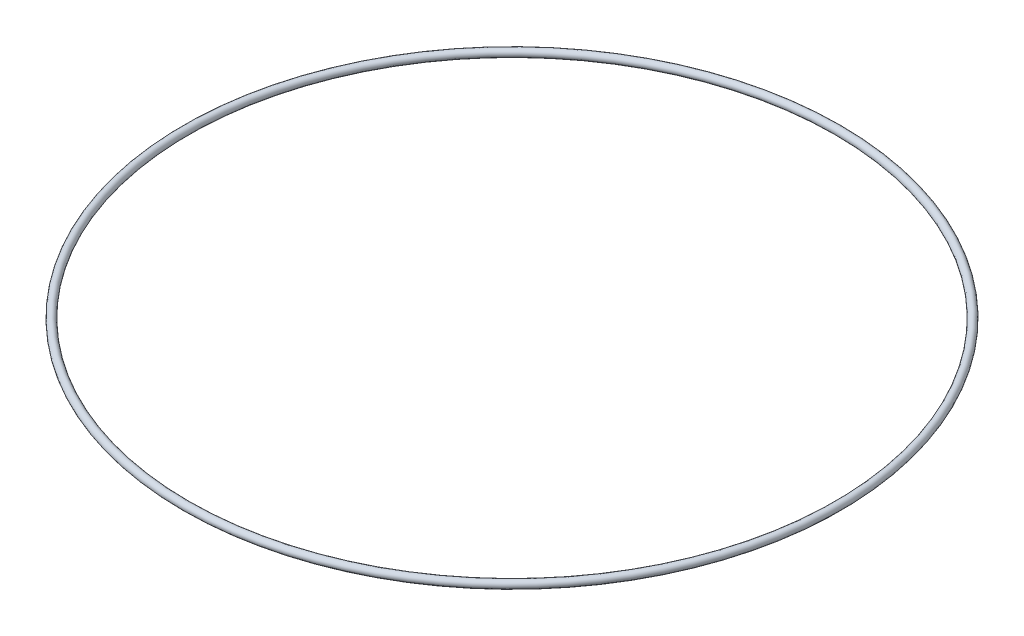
ISO-10303-21;
HEADER;
FILE_DESCRIPTION(('STEP AP214'),'2;1');
FILE_NAME('part.step','',(''),(''),'','','');
FILE_SCHEMA(('AUTOMOTIVE_DESIGN { 1 0 10303 214 1 1 1 1 }'));
ENDSEC;
DATA;
#1=APPLICATION_CONTEXT('core data for automotive mechanical design processes');
#2=APPLICATION_PROTOCOL_DEFINITION('international standard','automotive_design',2000,#1);
#3=PRODUCT_CONTEXT('',#1,'mechanical');
#4=PRODUCT('Part','Part','',(#3));
#5=PRODUCT_RELATED_PRODUCT_CATEGORY('part','',(#4));
#6=PRODUCT_DEFINITION_FORMATION('','',#4);
#7=PRODUCT_DEFINITION_CONTEXT('part definition',#1,'design');
#8=PRODUCT_DEFINITION('design','',#6,#7);
#9=PRODUCT_DEFINITION_SHAPE('','',#8);
#10=(LENGTH_UNIT() NAMED_UNIT(*) SI_UNIT(.MILLI.,.METRE.));
#11=(NAMED_UNIT(*) PLANE_ANGLE_UNIT() SI_UNIT($,.RADIAN.));
#12=(NAMED_UNIT(*) SI_UNIT($,.STERADIAN.) SOLID_ANGLE_UNIT());
#13=UNCERTAINTY_MEASURE_WITH_UNIT(LENGTH_MEASURE(1.E-05),#10,'distance_accuracy_value','');
#14=(GEOMETRIC_REPRESENTATION_CONTEXT(3) GLOBAL_UNCERTAINTY_ASSIGNED_CONTEXT((#13)) GLOBAL_UNIT_ASSIGNED_CONTEXT((#10,
#11,#12)) REPRESENTATION_CONTEXT('',''));
#15=CARTESIAN_POINT('',(0.,0.,0.));
#16=DIRECTION('',(0.,0.,1.));
#17=DIRECTION('',(1.,0.,0.));
#18=AXIS2_PLACEMENT_3D('',#15,#16,#17);
#19=CARTESIAN_POINT('',(0.,0.,0.));
#20=DIRECTION('',(0.,1.,0.));
#21=DIRECTION('',(0.,0.,1.));
#22=AXIS2_PLACEMENT_3D('',#19,#20,#21);
#23=TOROIDAL_SURFACE('',#22,127.25,1.5);
#24=CARTESIAN_POINT('',(0.,0.,128.75));
#25=VERTEX_POINT('',#24);
#26=VERTEX_LOOP('',#25);
#27=FACE_BOUND('',#26,.T.);
#28=ADVANCED_FACE('F29',(#27),#23,.T.);
#29=CLOSED_SHELL('',(#28));
#30=MANIFOLD_SOLID_BREP('B2',#29);
#31=ADVANCED_BREP_SHAPE_REPRESENTATION('',(#18,#30),#14);
#32=SHAPE_DEFINITION_REPRESENTATION(#9,#31);
ENDSEC;
END-ISO-10303-21;
